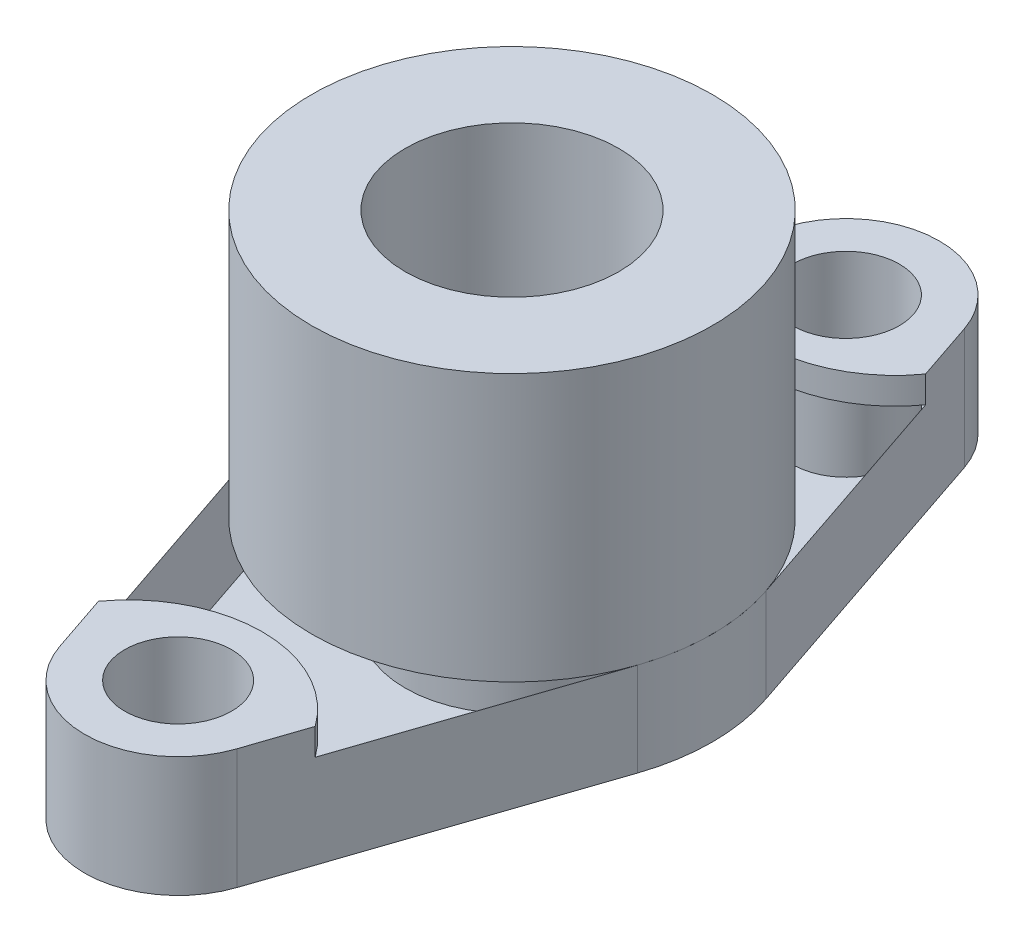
ISO-10303-21;
HEADER;
FILE_DESCRIPTION(('STEP AP214'),'2;1');
FILE_NAME('part.step','',(''),(''),'','','');
FILE_SCHEMA(('AUTOMOTIVE_DESIGN { 1 0 10303 214 1 1 1 1 }'));
ENDSEC;
DATA;
#1=APPLICATION_CONTEXT('core data for automotive mechanical design processes');
#2=APPLICATION_PROTOCOL_DEFINITION('international standard','automotive_design',2000,#1);
#3=PRODUCT_CONTEXT('',#1,'mechanical');
#4=PRODUCT('Part','Part','',(#3));
#5=PRODUCT_RELATED_PRODUCT_CATEGORY('part','',(#4));
#6=PRODUCT_DEFINITION_FORMATION('','',#4);
#7=PRODUCT_DEFINITION_CONTEXT('part definition',#1,'design');
#8=PRODUCT_DEFINITION('design','',#6,#7);
#9=PRODUCT_DEFINITION_SHAPE('','',#8);
#10=(LENGTH_UNIT() NAMED_UNIT(*) SI_UNIT(.MILLI.,.METRE.));
#11=(NAMED_UNIT(*) PLANE_ANGLE_UNIT() SI_UNIT($,.RADIAN.));
#12=(NAMED_UNIT(*) SI_UNIT($,.STERADIAN.) SOLID_ANGLE_UNIT());
#13=UNCERTAINTY_MEASURE_WITH_UNIT(LENGTH_MEASURE(1.E-05),#10,'distance_accuracy_value','');
#14=(GEOMETRIC_REPRESENTATION_CONTEXT(3) GLOBAL_UNCERTAINTY_ASSIGNED_CONTEXT((#13)) GLOBAL_UNIT_ASSIGNED_CONTEXT((#10,
#11,#12)) REPRESENTATION_CONTEXT('',''));
#15=CARTESIAN_POINT('',(0.,0.,0.));
#16=DIRECTION('',(0.,0.,1.));
#17=DIRECTION('',(1.,0.,0.));
#18=AXIS2_PLACEMENT_3D('',#15,#16,#17);
#19=CARTESIAN_POINT('',(0.,7.,0.));
#20=DIRECTION('',(0.,-1.,0.));
#21=DIRECTION('',(0.,0.,-1.));
#22=AXIS2_PLACEMENT_3D('',#19,#20,#21);
#23=PLANE('',#22);
#24=CARTESIAN_POINT('',(0.,7.,0.));
#25=DIRECTION('',(0.,-1.,0.));
#26=DIRECTION('',(0.,0.,-1.));
#27=AXIS2_PLACEMENT_3D('',#24,#25,#26);
#28=CIRCLE('',#27,15.);
#29=CARTESIAN_POINT('',(0.,7.,-15.));
#30=VERTEX_POINT('',#29);
#31=EDGE_CURVE('E11',#30,#30,#28,.T.);
#32=ORIENTED_EDGE('',*,*,#31,.T.);
#33=EDGE_LOOP('',(#32));
#34=FACE_BOUND('',#33,.T.);
#35=CARTESIAN_POINT('',(0.,7.,28.6951312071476));
#36=DIRECTION('',(0.,1.,0.));
#37=DIRECTION('',(0.,0.,1.));
#38=AXIS2_PLACEMENT_3D('',#35,#36,#37);
#39=CIRCLE('',#38,10.);
#40=CARTESIAN_POINT('',(8.11442154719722,7.,22.85080379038));
#41=VERTEX_POINT('',#40);
#42=CARTESIAN_POINT('',(-8.11442154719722,7.,22.85080379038));
#43=VERTEX_POINT('',#42);
#44=EDGE_CURVE('E153',#41,#43,#39,.T.);
#45=ORIENTED_EDGE('',*,*,#44,.F.);
#46=DIRECTION('',(-0.320000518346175,0.,0.947417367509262));
#47=VECTOR('',#46,1.);
#48=CARTESIAN_POINT('',(14.2112727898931,7.,4.80001192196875));
#49=LINE('',#48,#47);
#50=CARTESIAN_POINT('',(14.2112727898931,7.,4.80001192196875));
#51=VERTEX_POINT('',#50);
#52=EDGE_CURVE('E196',#51,#41,#49,.T.);
#53=ORIENTED_EDGE('',*,*,#52,.F.);
#54=CARTESIAN_POINT('',(0.,7.,0.));
#55=DIRECTION('',(0.,-1.,0.));
#56=DIRECTION('',(0.,0.,-1.));
#57=AXIS2_PLACEMENT_3D('',#54,#55,#56);
#58=CIRCLE('',#57,15.0000129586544);
#59=CARTESIAN_POINT('',(14.2112727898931,7.,-4.80001192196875));
#60=VERTEX_POINT('',#59);
#61=EDGE_CURVE('E193',#60,#51,#58,.T.);
#62=ORIENTED_EDGE('',*,*,#61,.F.);
#63=DIRECTION('',(0.320000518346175,0.,0.947417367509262));
#64=VECTOR('',#63,1.);
#65=CARTESIAN_POINT('',(14.2112727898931,7.,-4.80001192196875));
#66=LINE('',#65,#64);
#67=CARTESIAN_POINT('',(8.11442154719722,7.,-22.85080379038));
#68=VERTEX_POINT('',#67);
#69=EDGE_CURVE('E49',#68,#60,#66,.T.);
#70=ORIENTED_EDGE('',*,*,#69,.F.);
#71=CARTESIAN_POINT('',(0.,7.,-28.6951312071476));
#72=DIRECTION('',(0.,1.,0.));
#73=DIRECTION('',(0.,0.,-1.));
#74=AXIS2_PLACEMENT_3D('',#71,#72,#73);
#75=CIRCLE('',#74,9.99999999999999);
#76=CARTESIAN_POINT('',(-8.11442154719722,7.,-22.85080379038));
#77=VERTEX_POINT('',#76);
#78=EDGE_CURVE('E168',#77,#68,#75,.T.);
#79=ORIENTED_EDGE('',*,*,#78,.F.);
#80=DIRECTION('',(0.320000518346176,0.,-0.947417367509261));
#81=VECTOR('',#80,1.);
#82=CARTESIAN_POINT('',(-14.2112727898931,7.,-4.80001192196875));
#83=LINE('',#82,#81);
#84=CARTESIAN_POINT('',(-14.2112727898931,7.,-4.80001192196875));
#85=VERTEX_POINT('',#84);
#86=EDGE_CURVE('E204',#85,#77,#83,.T.);
#87=ORIENTED_EDGE('',*,*,#86,.F.);
#88=CARTESIAN_POINT('',(0.,7.,0.));
#89=DIRECTION('',(0.,-1.,0.));
#90=DIRECTION('',(0.,0.,-1.));
#91=AXIS2_PLACEMENT_3D('',#88,#89,#90);
#92=CIRCLE('',#91,15.0000129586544);
#93=CARTESIAN_POINT('',(-14.2112727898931,7.,4.80001192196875));
#94=VERTEX_POINT('',#93);
#95=EDGE_CURVE('E201',#94,#85,#92,.T.);
#96=ORIENTED_EDGE('',*,*,#95,.F.);
#97=DIRECTION('',(-0.320000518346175,0.,-0.947417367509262));
#98=VECTOR('',#97,1.);
#99=CARTESIAN_POINT('',(-6.63192157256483,7.,27.2400036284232));
#100=LINE('',#99,#98);
#101=EDGE_CURVE('E199',#43,#94,#100,.T.);
#102=ORIENTED_EDGE('',*,*,#101,.F.);
#103=EDGE_LOOP('',(#45,#53,#62,#70,#79,#87,#96,#102));
#104=FACE_BOUND('',#103,.T.);
#105=ADVANCED_FACE('F31',(#34,#104),#23,.F.);
#106=CARTESIAN_POINT('',(0.,27.,0.));
#107=DIRECTION('',(0.,-1.,0.));
#108=DIRECTION('',(0.,0.,-1.));
#109=AXIS2_PLACEMENT_3D('',#106,#107,#108);
#110=CYLINDRICAL_SURFACE('',#109,15.);
#111=CARTESIAN_POINT('',(0.,27.,0.));
#112=DIRECTION('',(0.,1.,0.));
#113=DIRECTION('',(0.,0.,1.));
#114=AXIS2_PLACEMENT_3D('',#111,#112,#113);
#115=CIRCLE('',#114,15.);
#116=CARTESIAN_POINT('',(0.,27.,15.));
#117=VERTEX_POINT('',#116);
#118=EDGE_CURVE('E35',#117,#117,#115,.T.);
#119=ORIENTED_EDGE('',*,*,#118,.F.);
#120=EDGE_LOOP('',(#119));
#121=FACE_BOUND('',#120,.T.);
#122=ORIENTED_EDGE('',*,*,#31,.F.);
#123=EDGE_LOOP('',(#122));
#124=FACE_BOUND('',#123,.T.);
#125=ADVANCED_FACE('F33',(#121,#124),#110,.T.);
#126=CARTESIAN_POINT('',(0.,27.,0.));
#127=DIRECTION('',(0.,1.,0.));
#128=DIRECTION('',(0.,0.,1.));
#129=AXIS2_PLACEMENT_3D('',#126,#127,#128);
#130=PLANE('',#129);
#131=ORIENTED_EDGE('',*,*,#118,.T.);
#132=EDGE_LOOP('',(#131));
#133=FACE_BOUND('',#132,.T.);
#134=CARTESIAN_POINT('',(0.,27.,0.));
#135=DIRECTION('',(0.,1.,0.));
#136=DIRECTION('',(0.,0.,1.));
#137=AXIS2_PLACEMENT_3D('',#134,#135,#136);
#138=CIRCLE('',#137,8.);
#139=CARTESIAN_POINT('',(0.,27.,8.));
#140=VERTEX_POINT('',#139);
#141=EDGE_CURVE('E237',#140,#140,#138,.T.);
#142=ORIENTED_EDGE('',*,*,#141,.F.);
#143=EDGE_LOOP('',(#142));
#144=FACE_BOUND('',#143,.T.);
#145=ADVANCED_FACE('F252',(#133,#144),#130,.T.);
#146=CARTESIAN_POINT('',(0.,0.,0.));
#147=DIRECTION('',(0.,1.,0.));
#148=DIRECTION('',(0.,0.,1.));
#149=AXIS2_PLACEMENT_3D('',#146,#147,#148);
#150=PLANE('',#149);
#151=CARTESIAN_POINT('',(0.,0.,0.));
#152=DIRECTION('',(0.,1.,0.));
#153=DIRECTION('',(0.,0.,1.));
#154=AXIS2_PLACEMENT_3D('',#151,#152,#153);
#155=CIRCLE('',#154,8.);
#156=CARTESIAN_POINT('',(0.,0.,8.));
#157=VERTEX_POINT('',#156);
#158=EDGE_CURVE('E227',#157,#157,#155,.T.);
#159=ORIENTED_EDGE('',*,*,#158,.T.);
#160=EDGE_LOOP('',(#159));
#161=FACE_BOUND('',#160,.T.);
#162=CARTESIAN_POINT('',(0.,0.,0.));
#163=DIRECTION('',(0.,-1.,0.));
#164=DIRECTION('',(0.,0.,-1.));
#165=AXIS2_PLACEMENT_3D('',#162,#163,#164);
#166=CIRCLE('',#165,15.0000129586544);
#167=CARTESIAN_POINT('',(14.2112727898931,0.,-4.80001192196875));
#168=VERTEX_POINT('',#167);
#169=CARTESIAN_POINT('',(14.2112727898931,0.,4.80001192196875));
#170=VERTEX_POINT('',#169);
#171=EDGE_CURVE('E192',#168,#170,#166,.T.);
#172=ORIENTED_EDGE('',*,*,#171,.T.);
#173=DIRECTION('',(-0.320000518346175,0.,0.947417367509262));
#174=VECTOR('',#173,1.);
#175=CARTESIAN_POINT('',(14.2112727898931,0.,4.80001192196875));
#176=LINE('',#175,#174);
#177=CARTESIAN_POINT('',(6.63192157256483,0.,27.2400036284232));
#178=VERTEX_POINT('',#177);
#179=EDGE_CURVE('E210',#170,#178,#176,.T.);
#180=ORIENTED_EDGE('',*,*,#179,.T.);
#181=CARTESIAN_POINT('',(0.,0.,25.));
#182=DIRECTION('',(0.,-1.,0.));
#183=DIRECTION('',(0.,0.,-1.));
#184=AXIS2_PLACEMENT_3D('',#181,#182,#183);
#185=CIRCLE('',#184,7.);
#186=CARTESIAN_POINT('',(-6.63192157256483,0.,27.2400036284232));
#187=VERTEX_POINT('',#186);
#188=EDGE_CURVE('E136',#178,#187,#185,.T.);
#189=ORIENTED_EDGE('',*,*,#188,.T.);
#190=DIRECTION('',(-0.320000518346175,0.,-0.947417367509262));
#191=VECTOR('',#190,1.);
#192=CARTESIAN_POINT('',(-6.63192157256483,0.,27.2400036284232));
#193=LINE('',#192,#191);
#194=CARTESIAN_POINT('',(-14.2112727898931,0.,4.80001192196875));
#195=VERTEX_POINT('',#194);
#196=EDGE_CURVE('E213',#187,#195,#193,.T.);
#197=ORIENTED_EDGE('',*,*,#196,.T.);
#198=CARTESIAN_POINT('',(0.,0.,0.));
#199=DIRECTION('',(0.,-1.,0.));
#200=DIRECTION('',(0.,0.,-1.));
#201=AXIS2_PLACEMENT_3D('',#198,#199,#200);
#202=CIRCLE('',#201,15.0000129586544);
#203=CARTESIAN_POINT('',(-14.2112727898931,0.,-4.80001192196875));
#204=VERTEX_POINT('',#203);
#205=EDGE_CURVE('E216',#195,#204,#202,.T.);
#206=ORIENTED_EDGE('',*,*,#205,.T.);
#207=DIRECTION('',(0.320000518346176,0.,-0.947417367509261));
#208=VECTOR('',#207,1.);
#209=CARTESIAN_POINT('',(-14.2112727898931,0.,-4.80001192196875));
#210=LINE('',#209,#208);
#211=CARTESIAN_POINT('',(-6.63192157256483,0.,-27.2400036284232));
#212=VERTEX_POINT('',#211);
#213=EDGE_CURVE('E219',#204,#212,#210,.T.);
#214=ORIENTED_EDGE('',*,*,#213,.T.);
#215=CARTESIAN_POINT('',(0.,0.,-25.));
#216=DIRECTION('',(0.,-1.,0.));
#217=DIRECTION('',(0.,0.,-1.));
#218=AXIS2_PLACEMENT_3D('',#215,#216,#217);
#219=CIRCLE('',#218,7.);
#220=CARTESIAN_POINT('',(6.63192157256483,0.,-27.2400036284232));
#221=VERTEX_POINT('',#220);
#222=EDGE_CURVE('E222',#212,#221,#219,.T.);
#223=ORIENTED_EDGE('',*,*,#222,.T.);
#224=DIRECTION('',(0.320000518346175,0.,0.947417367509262));
#225=VECTOR('',#224,1.);
#226=CARTESIAN_POINT('',(14.2112727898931,0.,-4.80001192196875));
#227=LINE('',#226,#225);
#228=EDGE_CURVE('E197',#221,#168,#227,.T.);
#229=ORIENTED_EDGE('',*,*,#228,.T.);
#230=EDGE_LOOP('',(#172,#180,#189,#197,#206,#214,#223,#229));
#231=FACE_BOUND('',#230,.T.);
#232=CARTESIAN_POINT('',(0.,0.,-25.));
#233=DIRECTION('',(0.,-1.,0.));
#234=DIRECTION('',(0.,0.,-1.));
#235=AXIS2_PLACEMENT_3D('',#232,#233,#234);
#236=CIRCLE('',#235,4.);
#237=CARTESIAN_POINT('',(0.,0.,-29.));
#238=VERTEX_POINT('',#237);
#239=EDGE_CURVE('E189',#238,#238,#236,.T.);
#240=ORIENTED_EDGE('',*,*,#239,.F.);
#241=EDGE_LOOP('',(#240));
#242=FACE_BOUND('',#241,.T.);
#243=CARTESIAN_POINT('',(0.,0.,25.));
#244=DIRECTION('',(0.,-1.,0.));
#245=DIRECTION('',(0.,0.,-1.));
#246=AXIS2_PLACEMENT_3D('',#243,#244,#245);
#247=CIRCLE('',#246,4.);
#248=CARTESIAN_POINT('',(0.,0.,21.));
#249=VERTEX_POINT('',#248);
#250=EDGE_CURVE('E186',#249,#249,#247,.T.);
#251=ORIENTED_EDGE('',*,*,#250,.F.);
#252=EDGE_LOOP('',(#251));
#253=FACE_BOUND('',#252,.T.);
#254=ADVANCED_FACE('F242',(#161,#231,#242,#253),#150,.F.);
#255=CARTESIAN_POINT('',(0.,27.,0.));
#256=DIRECTION('',(0.,-1.,0.));
#257=DIRECTION('',(0.,0.,-1.));
#258=AXIS2_PLACEMENT_3D('',#255,#256,#257);
#259=CYLINDRICAL_SURFACE('',#258,8.);
#260=ORIENTED_EDGE('',*,*,#158,.F.);
#261=EDGE_LOOP('',(#260));
#262=FACE_BOUND('',#261,.T.);
#263=ORIENTED_EDGE('',*,*,#141,.T.);
#264=EDGE_LOOP('',(#263));
#265=FACE_BOUND('',#264,.T.);
#266=ADVANCED_FACE('F245',(#262,#265),#259,.F.);
#267=CARTESIAN_POINT('',(0.,7.,0.));
#268=DIRECTION('',(0.,-1.,0.));
#269=DIRECTION('',(0.,0.,-1.));
#270=AXIS2_PLACEMENT_3D('',#267,#268,#269);
#271=CYLINDRICAL_SURFACE('',#270,15.0000129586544);
#272=ORIENTED_EDGE('',*,*,#171,.F.);
#273=DIRECTION('',(0.,-1.,0.));
#274=VECTOR('',#273,1.);
#275=CARTESIAN_POINT('',(14.2112727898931,7.,-4.80001192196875));
#276=LINE('',#275,#274);
#277=EDGE_CURVE('E84',#60,#168,#276,.T.);
#278=ORIENTED_EDGE('',*,*,#277,.F.);
#279=ORIENTED_EDGE('',*,*,#61,.T.);
#280=DIRECTION('',(0.,-1.,0.));
#281=VECTOR('',#280,1.);
#282=CARTESIAN_POINT('',(14.2112727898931,7.,4.80001192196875));
#283=LINE('',#282,#281);
#284=EDGE_CURVE('E91',#51,#170,#283,.T.);
#285=ORIENTED_EDGE('',*,*,#284,.T.);
#286=EDGE_LOOP('',(#272,#278,#279,#285));
#287=FACE_BOUND('',#286,.T.);
#288=ADVANCED_FACE('F248',(#287),#271,.T.);
#289=CARTESIAN_POINT('',(14.2112727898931,7.,-4.80001192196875));
#290=DIRECTION('',(0.947417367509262,0.,-0.320000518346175));
#291=DIRECTION('',(-0.320000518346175,0.,-0.947417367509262));
#292=AXIS2_PLACEMENT_3D('',#289,#290,#291);
#293=PLANE('',#292);
#294=ORIENTED_EDGE('',*,*,#228,.F.);
#295=DIRECTION('',(0.,-1.,0.));
#296=VECTOR('',#295,1.);
#297=CARTESIAN_POINT('',(6.63192157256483,7.,-27.2400036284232));
#298=LINE('',#297,#296);
#299=CARTESIAN_POINT('',(6.63192157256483,9.,-27.2400036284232));
#300=VERTEX_POINT('',#299);
#301=EDGE_CURVE('E80',#300,#221,#298,.T.);
#302=ORIENTED_EDGE('',*,*,#301,.F.);
#303=DIRECTION('',(-0.320000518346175,0.,-0.947417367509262));
#304=VECTOR('',#303,1.);
#305=CARTESIAN_POINT('',(6.63192157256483,9.,-27.2400036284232));
#306=LINE('',#305,#304);
#307=CARTESIAN_POINT('',(8.11442154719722,9.,-22.85080379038));
#308=VERTEX_POINT('',#307);
#309=EDGE_CURVE('E172',#308,#300,#306,.T.);
#310=ORIENTED_EDGE('',*,*,#309,.F.);
#311=DIRECTION('',(0.,-1.,0.));
#312=VECTOR('',#311,1.);
#313=CARTESIAN_POINT('',(8.11442154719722,9.,-22.85080379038));
#314=LINE('',#313,#312);
#315=EDGE_CURVE('E184',#308,#68,#314,.T.);
#316=ORIENTED_EDGE('',*,*,#315,.T.);
#317=ORIENTED_EDGE('',*,*,#69,.T.);
#318=ORIENTED_EDGE('',*,*,#277,.T.);
#319=EDGE_LOOP('',(#294,#302,#310,#316,#317,#318));
#320=FACE_BOUND('',#319,.T.);
#321=ADVANCED_FACE('F272',(#320),#293,.T.);
#322=CARTESIAN_POINT('',(0.,7.,-25.));
#323=DIRECTION('',(0.,-1.,0.));
#324=DIRECTION('',(0.,0.,-1.));
#325=AXIS2_PLACEMENT_3D('',#322,#323,#324);
#326=CYLINDRICAL_SURFACE('',#325,7.);
#327=ORIENTED_EDGE('',*,*,#222,.F.);
#328=DIRECTION('',(0.,-1.,0.));
#329=VECTOR('',#328,1.);
#330=CARTESIAN_POINT('',(-6.63192157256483,7.,-27.2400036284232));
#331=LINE('',#330,#329);
#332=CARTESIAN_POINT('',(-6.63192157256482,9.,-27.2400036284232));
#333=VERTEX_POINT('',#332);
#334=EDGE_CURVE('E229',#333,#212,#331,.T.);
#335=ORIENTED_EDGE('',*,*,#334,.F.);
#336=CARTESIAN_POINT('',(0.,9.,-25.));
#337=DIRECTION('',(0.,1.,0.));
#338=DIRECTION('',(0.,0.,1.));
#339=AXIS2_PLACEMENT_3D('',#336,#337,#338);
#340=CIRCLE('',#339,6.99999999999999);
#341=EDGE_CURVE('E175',#300,#333,#340,.T.);
#342=ORIENTED_EDGE('',*,*,#341,.F.);
#343=ORIENTED_EDGE('',*,*,#301,.T.);
#344=EDGE_LOOP('',(#327,#335,#342,#343));
#345=FACE_BOUND('',#344,.T.);
#346=ADVANCED_FACE('F275',(#345),#326,.T.);
#347=CARTESIAN_POINT('',(-14.2112727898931,7.,-4.80001192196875));
#348=DIRECTION('',(-0.947417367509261,0.,-0.320000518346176));
#349=DIRECTION('',(-0.320000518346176,0.,0.947417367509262));
#350=AXIS2_PLACEMENT_3D('',#347,#348,#349);
#351=PLANE('',#350);
#352=ORIENTED_EDGE('',*,*,#213,.F.);
#353=DIRECTION('',(0.,-1.,0.));
#354=VECTOR('',#353,1.);
#355=CARTESIAN_POINT('',(-14.2112727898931,7.,-4.80001192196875));
#356=LINE('',#355,#354);
#357=EDGE_CURVE('E231',#85,#204,#356,.T.);
#358=ORIENTED_EDGE('',*,*,#357,.F.);
#359=ORIENTED_EDGE('',*,*,#86,.T.);
#360=DIRECTION('',(0.,-1.,0.));
#361=VECTOR('',#360,1.);
#362=CARTESIAN_POINT('',(-8.11442154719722,9.,-22.85080379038));
#363=LINE('',#362,#361);
#364=CARTESIAN_POINT('',(-8.11442154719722,9.,-22.85080379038));
#365=VERTEX_POINT('',#364);
#366=EDGE_CURVE('E180',#365,#77,#363,.T.);
#367=ORIENTED_EDGE('',*,*,#366,.F.);
#368=DIRECTION('',(-0.320000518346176,0.,0.947417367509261));
#369=VECTOR('',#368,1.);
#370=CARTESIAN_POINT('',(-6.63192157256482,9.,-27.2400036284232));
#371=LINE('',#370,#369);
#372=EDGE_CURVE('E178',#333,#365,#371,.T.);
#373=ORIENTED_EDGE('',*,*,#372,.F.);
#374=ORIENTED_EDGE('',*,*,#334,.T.);
#375=EDGE_LOOP('',(#352,#358,#359,#367,#373,#374));
#376=FACE_BOUND('',#375,.T.);
#377=ADVANCED_FACE('F278',(#376),#351,.T.);
#378=CARTESIAN_POINT('',(0.,7.,0.));
#379=DIRECTION('',(0.,-1.,0.));
#380=DIRECTION('',(0.,0.,-1.));
#381=AXIS2_PLACEMENT_3D('',#378,#379,#380);
#382=CYLINDRICAL_SURFACE('',#381,15.0000129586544);
#383=ORIENTED_EDGE('',*,*,#205,.F.);
#384=DIRECTION('',(0.,-1.,0.));
#385=VECTOR('',#384,1.);
#386=CARTESIAN_POINT('',(-14.2112727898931,7.,4.80001192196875));
#387=LINE('',#386,#385);
#388=EDGE_CURVE('E233',#94,#195,#387,.T.);
#389=ORIENTED_EDGE('',*,*,#388,.F.);
#390=ORIENTED_EDGE('',*,*,#95,.T.);
#391=ORIENTED_EDGE('',*,*,#357,.T.);
#392=EDGE_LOOP('',(#383,#389,#390,#391));
#393=FACE_BOUND('',#392,.T.);
#394=ADVANCED_FACE('F281',(#393),#382,.T.);
#395=CARTESIAN_POINT('',(-6.63192157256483,7.,27.2400036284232));
#396=DIRECTION('',(-0.947417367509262,0.,0.320000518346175));
#397=DIRECTION('',(0.320000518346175,0.,0.947417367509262));
#398=AXIS2_PLACEMENT_3D('',#395,#396,#397);
#399=PLANE('',#398);
#400=ORIENTED_EDGE('',*,*,#196,.F.);
#401=DIRECTION('',(0.,-1.,0.));
#402=VECTOR('',#401,1.);
#403=CARTESIAN_POINT('',(-6.63192157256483,7.,27.2400036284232));
#404=LINE('',#403,#402);
#405=CARTESIAN_POINT('',(-6.63192157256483,9.,27.2400036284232));
#406=VERTEX_POINT('',#405);
#407=EDGE_CURVE('E138',#406,#187,#404,.T.);
#408=ORIENTED_EDGE('',*,*,#407,.F.);
#409=DIRECTION('',(0.320000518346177,0.,0.947417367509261));
#410=VECTOR('',#409,1.);
#411=CARTESIAN_POINT('',(-6.63192157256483,9.,27.2400036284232));
#412=LINE('',#411,#410);
#413=CARTESIAN_POINT('',(-8.11442154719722,9.,22.85080379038));
#414=VERTEX_POINT('',#413);
#415=EDGE_CURVE('E152',#414,#406,#412,.T.);
#416=ORIENTED_EDGE('',*,*,#415,.F.);
#417=DIRECTION('',(0.,-1.,0.));
#418=VECTOR('',#417,1.);
#419=CARTESIAN_POINT('',(-8.11442154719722,9.,22.85080379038));
#420=LINE('',#419,#418);
#421=EDGE_CURVE('E160',#414,#43,#420,.T.);
#422=ORIENTED_EDGE('',*,*,#421,.T.);
#423=ORIENTED_EDGE('',*,*,#101,.T.);
#424=ORIENTED_EDGE('',*,*,#388,.T.);
#425=EDGE_LOOP('',(#400,#408,#416,#422,#423,#424));
#426=FACE_BOUND('',#425,.T.);
#427=ADVANCED_FACE('F285',(#426),#399,.T.);
#428=CARTESIAN_POINT('',(0.,7.,25.));
#429=DIRECTION('',(0.,-1.,0.));
#430=DIRECTION('',(0.,0.,-1.));
#431=AXIS2_PLACEMENT_3D('',#428,#429,#430);
#432=CYLINDRICAL_SURFACE('',#431,7.);
#433=ORIENTED_EDGE('',*,*,#188,.F.);
#434=DIRECTION('',(0.,-1.,0.));
#435=VECTOR('',#434,1.);
#436=CARTESIAN_POINT('',(6.63192157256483,7.,27.2400036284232));
#437=LINE('',#436,#435);
#438=CARTESIAN_POINT('',(6.63192157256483,9.,27.2400036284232));
#439=VERTEX_POINT('',#438);
#440=EDGE_CURVE('E130',#439,#178,#437,.T.);
#441=ORIENTED_EDGE('',*,*,#440,.F.);
#442=CARTESIAN_POINT('',(0.,9.,25.));
#443=DIRECTION('',(0.,1.,0.));
#444=DIRECTION('',(0.,0.,-1.));
#445=AXIS2_PLACEMENT_3D('',#442,#443,#444);
#446=CIRCLE('',#445,7.);
#447=EDGE_CURVE('E134',#406,#439,#446,.T.);
#448=ORIENTED_EDGE('',*,*,#447,.F.);
#449=ORIENTED_EDGE('',*,*,#407,.T.);
#450=EDGE_LOOP('',(#433,#441,#448,#449));
#451=FACE_BOUND('',#450,.T.);
#452=ADVANCED_FACE('F132',(#451),#432,.T.);
#453=CARTESIAN_POINT('',(14.2112727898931,7.,4.80001192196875));
#454=DIRECTION('',(0.947417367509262,0.,0.320000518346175));
#455=DIRECTION('',(0.320000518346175,0.,-0.947417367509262));
#456=AXIS2_PLACEMENT_3D('',#453,#454,#455);
#457=PLANE('',#456);
#458=ORIENTED_EDGE('',*,*,#179,.F.);
#459=ORIENTED_EDGE('',*,*,#284,.F.);
#460=ORIENTED_EDGE('',*,*,#52,.T.);
#461=DIRECTION('',(0.,-1.,0.));
#462=VECTOR('',#461,1.);
#463=CARTESIAN_POINT('',(8.11442154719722,9.,22.85080379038));
#464=LINE('',#463,#462);
#465=CARTESIAN_POINT('',(8.11442154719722,9.,22.85080379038));
#466=VERTEX_POINT('',#465);
#467=EDGE_CURVE('E143',#466,#41,#464,.T.);
#468=ORIENTED_EDGE('',*,*,#467,.F.);
#469=DIRECTION('',(0.320000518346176,0.,-0.947417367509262));
#470=VECTOR('',#469,1.);
#471=CARTESIAN_POINT('',(6.63192157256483,9.,27.2400036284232));
#472=LINE('',#471,#470);
#473=EDGE_CURVE('E141',#439,#466,#472,.T.);
#474=ORIENTED_EDGE('',*,*,#473,.F.);
#475=ORIENTED_EDGE('',*,*,#440,.T.);
#476=EDGE_LOOP('',(#458,#459,#460,#468,#474,#475));
#477=FACE_BOUND('',#476,.T.);
#478=ADVANCED_FACE('F142',(#477),#457,.T.);
#479=CARTESIAN_POINT('',(0.,7.,-25.));
#480=DIRECTION('',(0.,-1.,0.));
#481=DIRECTION('',(0.,0.,-1.));
#482=AXIS2_PLACEMENT_3D('',#479,#480,#481);
#483=CYLINDRICAL_SURFACE('',#482,4.);
#484=ORIENTED_EDGE('',*,*,#239,.T.);
#485=EDGE_LOOP('',(#484));
#486=FACE_BOUND('',#485,.T.);
#487=CARTESIAN_POINT('',(0.,9.,-25.));
#488=DIRECTION('',(0.,1.,0.));
#489=DIRECTION('',(0.,0.,1.));
#490=AXIS2_PLACEMENT_3D('',#487,#488,#489);
#491=CIRCLE('',#490,4.);
#492=CARTESIAN_POINT('',(0.,9.,-21.));
#493=VERTEX_POINT('',#492);
#494=EDGE_CURVE('E165',#493,#493,#491,.T.);
#495=ORIENTED_EDGE('',*,*,#494,.T.);
#496=EDGE_LOOP('',(#495));
#497=FACE_BOUND('',#496,.T.);
#498=ADVANCED_FACE('F270',(#486,#497),#483,.F.);
#499=CARTESIAN_POINT('',(0.,7.,25.));
#500=DIRECTION('',(0.,-1.,0.));
#501=DIRECTION('',(0.,0.,-1.));
#502=AXIS2_PLACEMENT_3D('',#499,#500,#501);
#503=CYLINDRICAL_SURFACE('',#502,4.);
#504=ORIENTED_EDGE('',*,*,#250,.T.);
#505=EDGE_LOOP('',(#504));
#506=FACE_BOUND('',#505,.T.);
#507=CARTESIAN_POINT('',(0.,9.,25.));
#508=DIRECTION('',(0.,1.,0.));
#509=DIRECTION('',(0.,0.,-1.));
#510=AXIS2_PLACEMENT_3D('',#507,#508,#509);
#511=CIRCLE('',#510,4.);
#512=CARTESIAN_POINT('',(0.,9.,21.));
#513=VERTEX_POINT('',#512);
#514=EDGE_CURVE('E155',#513,#513,#511,.T.);
#515=ORIENTED_EDGE('',*,*,#514,.T.);
#516=EDGE_LOOP('',(#515));
#517=FACE_BOUND('',#516,.T.);
#518=ADVANCED_FACE('F330',(#506,#517),#503,.F.);
#519=CARTESIAN_POINT('',(0.,9.,-28.6951312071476));
#520=DIRECTION('',(0.,-1.,0.));
#521=DIRECTION('',(0.,0.,-1.));
#522=AXIS2_PLACEMENT_3D('',#519,#520,#521);
#523=PLANE('',#522);
#524=CARTESIAN_POINT('',(0.,9.,-28.6951312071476));
#525=DIRECTION('',(0.,1.,0.));
#526=DIRECTION('',(0.,0.,-1.));
#527=AXIS2_PLACEMENT_3D('',#524,#525,#526);
#528=CIRCLE('',#527,9.99999999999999);
#529=EDGE_CURVE('E169',#365,#308,#528,.T.);
#530=ORIENTED_EDGE('',*,*,#529,.T.);
#531=ORIENTED_EDGE('',*,*,#309,.T.);
#532=ORIENTED_EDGE('',*,*,#341,.T.);
#533=ORIENTED_EDGE('',*,*,#372,.T.);
#534=EDGE_LOOP('',(#530,#531,#532,#533));
#535=FACE_BOUND('',#534,.T.);
#536=ORIENTED_EDGE('',*,*,#494,.F.);
#537=EDGE_LOOP('',(#536));
#538=FACE_BOUND('',#537,.T.);
#539=ADVANCED_FACE('F301',(#535,#538),#523,.F.);
#540=CARTESIAN_POINT('',(0.,9.,-28.6951312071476));
#541=DIRECTION('',(0.,-1.,0.));
#542=DIRECTION('',(0.,0.,-1.));
#543=AXIS2_PLACEMENT_3D('',#540,#541,#542);
#544=CYLINDRICAL_SURFACE('',#543,9.99999999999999);
#545=ORIENTED_EDGE('',*,*,#78,.T.);
#546=ORIENTED_EDGE('',*,*,#315,.F.);
#547=ORIENTED_EDGE('',*,*,#529,.F.);
#548=ORIENTED_EDGE('',*,*,#366,.T.);
#549=EDGE_LOOP('',(#545,#546,#547,#548));
#550=FACE_BOUND('',#549,.T.);
#551=ADVANCED_FACE('F311',(#550),#544,.T.);
#552=CARTESIAN_POINT('',(0.,9.,25.));
#553=DIRECTION('',(0.,-1.,0.));
#554=DIRECTION('',(0.,0.,-1.));
#555=AXIS2_PLACEMENT_3D('',#552,#553,#554);
#556=PLANE('',#555);
#557=ORIENTED_EDGE('',*,*,#447,.T.);
#558=ORIENTED_EDGE('',*,*,#473,.T.);
#559=CARTESIAN_POINT('',(0.,9.,28.6951312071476));
#560=DIRECTION('',(0.,1.,0.));
#561=DIRECTION('',(0.,0.,1.));
#562=AXIS2_PLACEMENT_3D('',#559,#560,#561);
#563=CIRCLE('',#562,10.);
#564=EDGE_CURVE('E146',#466,#414,#563,.T.);
#565=ORIENTED_EDGE('',*,*,#564,.T.);
#566=ORIENTED_EDGE('',*,*,#415,.T.);
#567=EDGE_LOOP('',(#557,#558,#565,#566));
#568=FACE_BOUND('',#567,.T.);
#569=ORIENTED_EDGE('',*,*,#514,.F.);
#570=EDGE_LOOP('',(#569));
#571=FACE_BOUND('',#570,.T.);
#572=ADVANCED_FACE('F149',(#568,#571),#556,.F.);
#573=CARTESIAN_POINT('',(0.,9.,28.6951312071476));
#574=DIRECTION('',(0.,-1.,0.));
#575=DIRECTION('',(0.,0.,-1.));
#576=AXIS2_PLACEMENT_3D('',#573,#574,#575);
#577=CYLINDRICAL_SURFACE('',#576,10.);
#578=ORIENTED_EDGE('',*,*,#44,.T.);
#579=ORIENTED_EDGE('',*,*,#421,.F.);
#580=ORIENTED_EDGE('',*,*,#564,.F.);
#581=ORIENTED_EDGE('',*,*,#467,.T.);
#582=EDGE_LOOP('',(#578,#579,#580,#581));
#583=FACE_BOUND('',#582,.T.);
#584=ADVANCED_FACE('F317',(#583),#577,.T.);
#585=CLOSED_SHELL('',(#105,#125,#145,#254,#266,#288,#321,#346,#377,#394,#427,#452,#478,#498,
#518,#539,#551,#572,#584));
#586=MANIFOLD_SOLID_BREP('B2',#585);
#587=ADVANCED_BREP_SHAPE_REPRESENTATION('',(#18,#586),#14);
#588=SHAPE_DEFINITION_REPRESENTATION(#9,#587);
ENDSEC;
END-ISO-10303-21;
